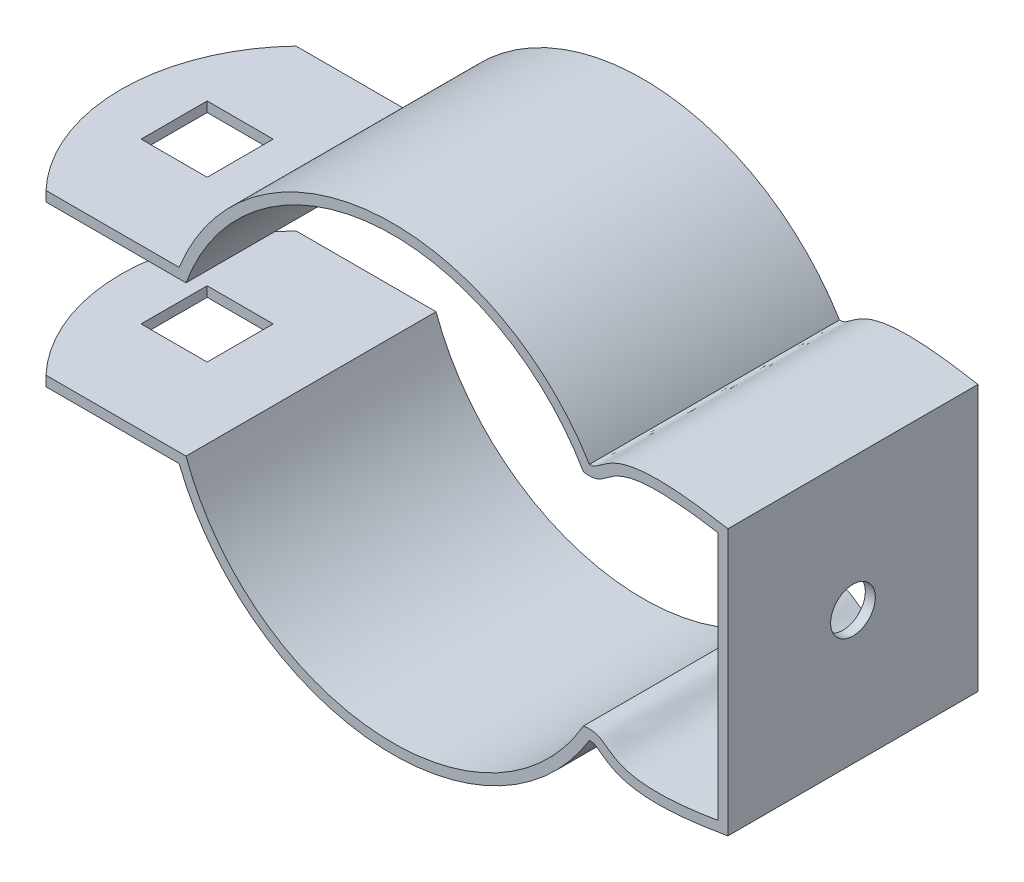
from build123d import *

# Parameters (mm, degrees)
BOSS_EXTRUDE1_DEPTH = 25
BOSS_EXTRUDE2_START = -17
BOSS_EXTRUDE2_DEPTH = 17
SKETCH3_W           = 25
SKETCH3_H           = 15
CUT_EXTRUDE1_DEPTH  = 25
SKETCH4_W           = 6.604
SKETCH4_H           = 6.604
CUT_EXTRUDE2_DEPTH  = 25
SKETCH6_R           = 2.23393
CUT_EXTRUDE3_DEPTH  = 25


with BuildPart() as part:
    # Sketch1 → Boss-Extrude1 (new body)
    with BuildSketch(Plane.XY):
        with BuildLine():
            Line((33.5, 13.298044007), (33.5, -13.298044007))
            add(Edge.make_bspline(
                [(19.65094265, -11.951587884), (19.742913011, -11.952134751), (19.947651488, -11.97183094), (20.123276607, -12.028988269), (20.319404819, -12.125950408), (20.646465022, -12.34605662), (21.230950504, -12.809282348), (22.329324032, -13.444630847), (23.915910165, -13.915522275), (25.759157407, -14.08463513), (27.655328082, -14.045416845), (29.319061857, -13.916276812), (30.925633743, -13.7163477), (32.369560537, -13.491663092), (33.12610434, -13.361293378), (33.5, -13.298044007)],
                knots=[0.055208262, 0.055208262, 0.055208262, 0.055208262, 0.1066459, 0.158083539, 0.209521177, 0.260958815, 0.363834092, 0.466709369, 0.569584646, 0.672459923, 0.723897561, 0.775335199, 0.826772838, 0.852491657, 0.878210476, 0.878210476, 0.878210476, 0.878210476], degree=3))
            ThreePointArc((19.65094265, -11.951587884), (-1.928373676, -22.919017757), (-21.371710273, -8.5))
            Line((-21.371710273, -8.5), (-34.68211788, -8.5))
            Line((-34.68211788, -8.5), (-34.68211788, -7.5))
            Line((-34.68211788, -7.5), (-20.68211788, -7.5))
            ThreePointArc((-20.68211788, -7.5), (-1.93037966, -21.915146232), (19.052558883, -11))
            add(Edge.make_bspline(
                [(19.052558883, -11), (22.544284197, -10.4663624), (20.029109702, -14.562615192), (32.5, -12.453)],
                knots=[0, 0, 0, 0, 0.8590782, 0.8590782, 0.8590782, 0.8590782], degree=3))
            Line((32.5, -12.453), (32.5, 12.453))
            add(Edge.make_bspline(
                [(19.052558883, 11), (22.544284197, 10.4663624), (20.029109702, 14.562615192), (32.5, 12.453)],
                knots=[0, 0, 0, 0, 0.8590782, 0.8590782, 0.8590782, 0.8590782], degree=3))
            ThreePointArc((19.052558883, 11), (-1.93037966, 21.915146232), (-20.68211788, 7.5))
            Line((-20.68211788, 7.5), (-34.68211788, 7.5))
            Line((-34.68211788, 7.5), (-34.68211788, 8.5))
            Line((-34.68211788, 8.5), (-21.371710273, 8.5))
            ThreePointArc((-21.371710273, 8.5), (-1.928373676, 22.919017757), (19.65094265, 11.951587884))
            add(Edge.make_bspline(
                [(33.5, 13.298044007), (33.12610434, 13.361293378), (32.369560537, 13.491663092), (30.925633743, 13.7163477), (29.319061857, 13.916276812), (27.655328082, 14.045416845), (25.759157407, 14.08463513), (23.915910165, 13.915522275), (22.329324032, 13.444630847), (21.230950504, 12.809282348), (20.646465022, 12.34605662), (20.319404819, 12.125950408), (20.123276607, 12.028988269), (19.947651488, 11.97183094), (19.742913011, 11.952134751), (19.65094265, 11.951587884)],
                knots=[0.055208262, 0.055208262, 0.055208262, 0.055208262, 0.080927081, 0.1066459, 0.158083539, 0.209521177, 0.260958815, 0.363834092, 0.466709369, 0.569584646, 0.672459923, 0.723897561, 0.775335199, 0.826772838, 0.878210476, 0.878210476, 0.878210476, 0.878210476], degree=3))
        make_face()
    extrude(amount=BOSS_EXTRUDE1_DEPTH)

    # Sketch2 → Boss-Extrude2 (add)
    with BuildSketch(Plane.XZ.offset(8.5).offset(BOSS_EXTRUDE2_START)):
        with BuildLine():
            Line((-34.68211788, 25), (-34.68211788, 0))
            ThreePointArc((-34.68211788, 0), (-39.68211788, 12.5), (-34.68211788, 25))
        make_face()
    boss_extrude2 = extrude(amount=BOSS_EXTRUDE2_DEPTH)

    # Mirror1: Boss-Extrude2 across plane
    add(boss_extrude2.mirror(Plane.ZX))

    # Sketch3 → Cut-Extrude1 (cut)
    with BuildSketch(Plane(origin=(-34.68211788, 0, 0), x_dir=(0, 0, -1), z_dir=(1, 0, 0))):
        with Locations((-12.5, 0)):
            Rectangle(SKETCH3_W, SKETCH3_H)
    extrude(amount=-CUT_EXTRUDE1_DEPTH, mode=Mode.SUBTRACT)

    # Sketch4 → Cut-Extrude2 (cut)
    with BuildSketch(Plane.XZ.offset(8.5)):
        with Locations((-31.069710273, 12.5)):
            Rectangle(SKETCH4_W, SKETCH4_H)
    extrude(amount=-CUT_EXTRUDE2_DEPTH, mode=Mode.SUBTRACT)

    # Sketch6 → Cut-Extrude3 (cut)
    with BuildSketch(Plane(origin=(33.5, 0, 0), x_dir=(0, 0, -1), z_dir=(1, 0, 0))):
        with Locations((-12.5, 0)):
            Circle(SKETCH6_R)
    extrude(amount=-CUT_EXTRUDE3_DEPTH, mode=Mode.SUBTRACT)


solid = part.part
